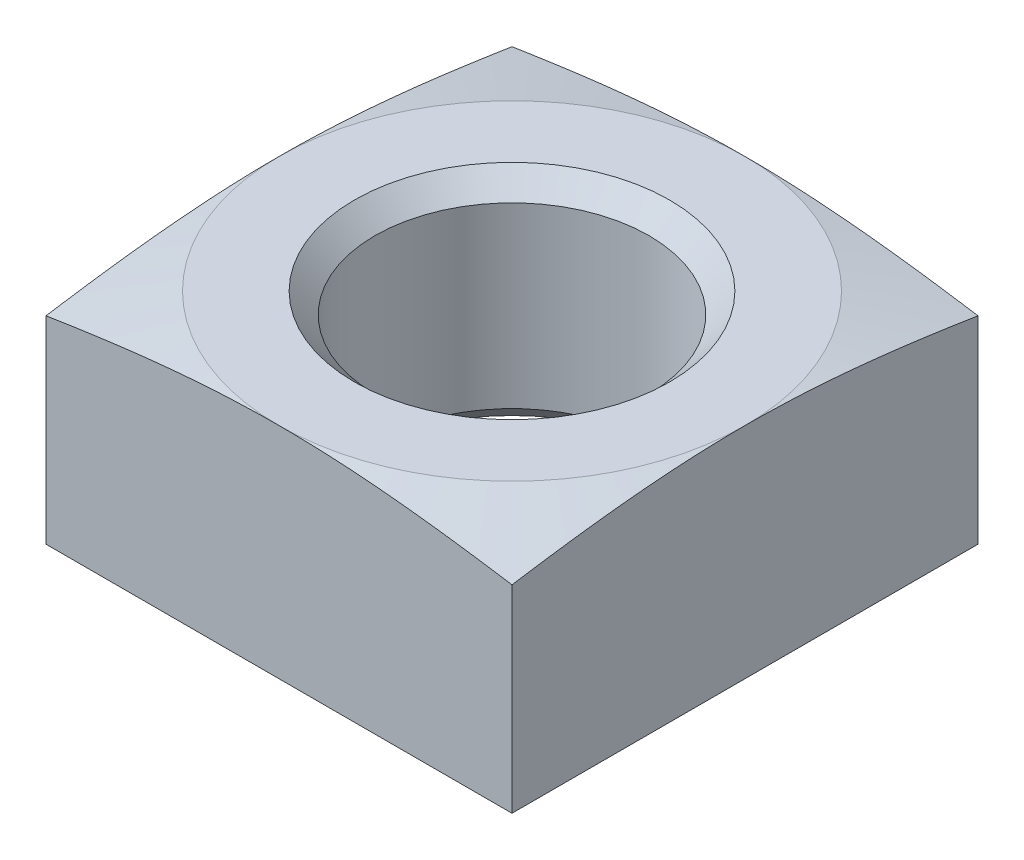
ISO-10303-21;
HEADER;
FILE_DESCRIPTION(('STEP AP214'),'2;1');
FILE_NAME('part.step','',(''),(''),'','','');
FILE_SCHEMA(('AUTOMOTIVE_DESIGN { 1 0 10303 214 1 1 1 1 }'));
ENDSEC;
DATA;
#1=APPLICATION_CONTEXT('core data for automotive mechanical design processes');
#2=APPLICATION_PROTOCOL_DEFINITION('international standard','automotive_design',2000,#1);
#3=PRODUCT_CONTEXT('',#1,'mechanical');
#4=PRODUCT('Part','Part','',(#3));
#5=PRODUCT_RELATED_PRODUCT_CATEGORY('part','',(#4));
#6=PRODUCT_DEFINITION_FORMATION('','',#4);
#7=PRODUCT_DEFINITION_CONTEXT('part definition',#1,'design');
#8=PRODUCT_DEFINITION('design','',#6,#7);
#9=PRODUCT_DEFINITION_SHAPE('','',#8);
#10=(LENGTH_UNIT() NAMED_UNIT(*) SI_UNIT(.MILLI.,.METRE.));
#11=(NAMED_UNIT(*) PLANE_ANGLE_UNIT() SI_UNIT($,.RADIAN.));
#12=(NAMED_UNIT(*) SI_UNIT($,.STERADIAN.) SOLID_ANGLE_UNIT());
#13=UNCERTAINTY_MEASURE_WITH_UNIT(LENGTH_MEASURE(1.E-05),#10,'distance_accuracy_value','');
#14=(GEOMETRIC_REPRESENTATION_CONTEXT(3) GLOBAL_UNCERTAINTY_ASSIGNED_CONTEXT((#13)) GLOBAL_UNIT_ASSIGNED_CONTEXT((#10,
#11,#12)) REPRESENTATION_CONTEXT('',''));
#15=CARTESIAN_POINT('',(0.,0.,0.));
#16=DIRECTION('',(0.,0.,1.));
#17=DIRECTION('',(1.,0.,0.));
#18=AXIS2_PLACEMENT_3D('',#15,#16,#17);
#19=CARTESIAN_POINT('',(8.5,4.,8.5));
#20=DIRECTION('',(0.,0.,-1.));
#21=DIRECTION('',(0.,1.,0.));
#22=AXIS2_PLACEMENT_3D('',#19,#20,#21);
#23=PLANE('',#22);
#24=DIRECTION('',(0.,-1.,0.));
#25=VECTOR('',#24,1.);
#26=CARTESIAN_POINT('',(8.5,4.,8.5));
#27=LINE('',#26,#25);
#28=CARTESIAN_POINT('',(8.5,3.21759660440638,8.5));
#29=VERTEX_POINT('',#28);
#30=CARTESIAN_POINT('',(8.5,-4.,8.5));
#31=VERTEX_POINT('',#30);
#32=EDGE_CURVE('E122',#29,#31,#27,.T.);
#33=ORIENTED_EDGE('',*,*,#32,.F.);
#34=CARTESIAN_POINT('',(-16.9605384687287,1.67304654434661,8.5));
#35=CARTESIAN_POINT('',(-16.5201000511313,1.76053361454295,8.5));
#36=CARTESIAN_POINT('',(-16.0795348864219,1.84738932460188,8.5));
#37=CARTESIAN_POINT('',(-15.1980862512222,2.01949712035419,8.5));
#38=CARTESIAN_POINT('',(-14.7572027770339,2.10474918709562,8.5));
#39=CARTESIAN_POINT('',(-13.875113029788,2.27329717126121,8.5));
#40=CARTESIAN_POINT('',(-13.4339067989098,2.35659330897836,8.5));
#41=CARTESIAN_POINT('',(-12.5510455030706,2.52077207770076,8.5));
#42=CARTESIAN_POINT('',(-12.1093904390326,2.60165471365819,8.5));
#43=CARTESIAN_POINT('',(-11.2271153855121,2.76012260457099,8.5));
#44=CARTESIAN_POINT('',(-10.7864973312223,2.83771860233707,8.5));
#45=CARTESIAN_POINT('',(-9.90461451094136,2.98914012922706,8.5));
#46=CARTESIAN_POINT('',(-9.46334974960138,3.06296568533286,8.5));
#47=CARTESIAN_POINT('',(-8.5798734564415,3.20586133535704,8.5));
#48=CARTESIAN_POINT('',(-8.13766162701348,3.2749295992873,8.5));
#49=CARTESIAN_POINT('',(-7.25231996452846,3.4069697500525,8.5));
#50=CARTESIAN_POINT('',(-6.80919012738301,3.46994160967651,8.5));
#51=CARTESIAN_POINT('',(-5.91813488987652,3.58863560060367,8.5));
#52=CARTESIAN_POINT('',(-5.4702006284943,3.64429191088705,8.5));
#53=CARTESIAN_POINT('',(-4.57319525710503,3.74568121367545,8.5));
#54=CARTESIAN_POINT('',(-4.12412414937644,3.79141422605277,8.5));
#55=CARTESIAN_POINT('',(-3.22526413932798,3.87066936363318,8.5));
#56=CARTESIAN_POINT('',(-2.77547615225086,3.90420167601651,8.5));
#57=CARTESIAN_POINT('',(-1.87505584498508,3.9569925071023,8.5));
#58=CARTESIAN_POINT('',(-1.42442354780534,3.97625140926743,8.5));
#59=CARTESIAN_POINT('',(-0.521521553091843,3.99907945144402,8.5));
#60=CARTESIAN_POINT('',(-0.0692507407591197,4.00260567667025,8.5));
#61=CARTESIAN_POINT('',(0.835127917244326,3.99356248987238,8.5));
#62=CARTESIAN_POINT('',(1.28723576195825,3.98099298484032,8.5));
#63=CARTESIAN_POINT('',(2.19111156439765,3.94073999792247,8.5));
#64=CARTESIAN_POINT('',(2.6428789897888,3.91304484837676,8.5));
#65=CARTESIAN_POINT('',(3.54538769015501,3.84444705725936,8.5));
#66=CARTESIAN_POINT('',(3.99612896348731,3.80354439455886,8.5));
#67=CARTESIAN_POINT('',(5.08609560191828,3.69128893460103,8.5));
#68=CARTESIAN_POINT('',(5.72474126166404,3.61436713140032,8.5));
#69=CARTESIAN_POINT('',(6.99993141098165,3.44456325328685,8.5));
#70=CARTESIAN_POINT('',(7.63647561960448,3.35167912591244,8.5));
#71=CARTESIAN_POINT('',(8.90806817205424,3.15459628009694,8.5));
#72=CARTESIAN_POINT('',(9.54311576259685,3.05039275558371,8.5));
#73=CARTESIAN_POINT('',(10.8118046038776,2.83399980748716,8.5));
#74=CARTESIAN_POINT('',(11.4454459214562,2.72181077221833,8.5));
#75=CARTESIAN_POINT('',(12.7126546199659,2.49151420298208,8.5));
#76=CARTESIAN_POINT('',(13.3462203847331,2.37339782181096,8.5));
#77=CARTESIAN_POINT('',(14.6125540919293,2.1329473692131,8.5));
#78=CARTESIAN_POINT('',(15.2453220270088,2.01061325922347,8.5));
#79=CARTESIAN_POINT('',(16.5100787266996,1.76282780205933,8.5));
#80=CARTESIAN_POINT('',(17.1420676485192,1.63737725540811,8.5));
#81=CARTESIAN_POINT('',(18.4055605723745,1.3840726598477,8.5));
#82=CARTESIAN_POINT('',(19.0370645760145,1.25621861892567,8.5));
#83=CARTESIAN_POINT('',(20.9252709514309,0.871062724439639,8.5));
#84=CARTESIAN_POINT('',(22.1814157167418,0.611029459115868,8.5));
#85=CARTESIAN_POINT('',(24.6928419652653,0.0863551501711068,8.5));
#86=CARTESIAN_POINT('',(25.948123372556,-0.17828625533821,8.5));
#87=CARTESIAN_POINT('',(28.4538843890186,-0.709780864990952,8.5));
#88=CARTESIAN_POINT('',(29.7043661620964,-0.976623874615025,8.5));
#89=CARTESIAN_POINT('',(31.5796887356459,-1.37849023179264,8.5));
#90=CARTESIAN_POINT('',(32.2047027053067,-1.51270685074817,8.5));
#91=CARTESIAN_POINT('',(33.4546309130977,-1.78160238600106,8.5));
#92=CARTESIAN_POINT('',(34.0795451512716,-1.91628130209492,8.5));
#93=CARTESIAN_POINT('',(34.7044176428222,-2.0511537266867,8.5));
#94=B_SPLINE_CURVE_WITH_KNOTS('',3,(#34,#35,#36,#37,#38,#39,#40,#41,#42,#43,#44,#45,#46,#47,#48,
#49,#50,#51,#52,#53,#54,#55,#56,#57,#58,#59,#60,#61,#62,#63,#64,#65,#66,#67,#68,#69,#70,#71,#72,
#73,#74,#75,#76,#77,#78,#79,#80,#81,#82,#83,#84,#85,#86,#87,#88,#89,#90,#91,#92,#93),
.UNSPECIFIED.,.F.,.F.,(4,2,2,2,2,2,2,2,2,2,2,2,2,2,2,2,2,2,2,2,2,2,2,2,2,2,2,2,2,4),(0.,
1.347131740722,2.69427939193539,4.0412745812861,5.38826700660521,6.7304496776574,
8.07262274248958,9.41530925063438,10.7580017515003,12.1120504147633,13.466096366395,
14.8190091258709,16.1718855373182,17.5284500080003,18.8850223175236,20.2426425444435,
21.6002649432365,23.52974237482,25.4594680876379,27.3900163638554,29.3204708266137,
31.2538977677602,33.1873423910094,35.120295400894,37.0532419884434,40.9015569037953,
44.7501754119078,48.5860802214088,50.5038676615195,52.4216542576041),.UNSPECIFIED.);
#95=CARTESIAN_POINT('',(0.,4.,8.5));
#96=VERTEX_POINT('',#95);
#97=EDGE_CURVE('E99',#29,#96,#94,.F.);
#98=ORIENTED_EDGE('',*,*,#97,.T.);
#99=CARTESIAN_POINT('',(-8.5,3.21759660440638,8.5));
#100=VERTEX_POINT('',#99);
#101=EDGE_CURVE('E112',#96,#100,#94,.F.);
#102=ORIENTED_EDGE('',*,*,#101,.T.);
#103=DIRECTION('',(0.,-1.,0.));
#104=VECTOR('',#103,1.);
#105=CARTESIAN_POINT('',(-8.5,4.,8.5));
#106=LINE('',#105,#104);
#107=CARTESIAN_POINT('',(-8.5,-4.,8.5));
#108=VERTEX_POINT('',#107);
#109=EDGE_CURVE('E185',#100,#108,#106,.T.);
#110=ORIENTED_EDGE('',*,*,#109,.T.);
#111=DIRECTION('',(-1.,0.,0.));
#112=VECTOR('',#111,1.);
#113=CARTESIAN_POINT('',(8.5,-4.,8.5));
#114=LINE('',#113,#112);
#115=EDGE_CURVE('E194',#31,#108,#114,.T.);
#116=ORIENTED_EDGE('',*,*,#115,.F.);
#117=EDGE_LOOP('',(#33,#98,#102,#110,#116));
#118=FACE_BOUND('',#117,.T.);
#119=ADVANCED_FACE('F39',(#118),#23,.F.);
#120=CARTESIAN_POINT('',(8.5,-4.,-8.5));
#121=DIRECTION('',(0.,1.,0.));
#122=DIRECTION('',(0.,0.,1.));
#123=AXIS2_PLACEMENT_3D('',#120,#121,#122);
#124=PLANE('',#123);
#125=CARTESIAN_POINT('',(0.,-4.,0.));
#126=DIRECTION('',(0.,1.,0.));
#127=DIRECTION('',(0.,0.,1.));
#128=AXIS2_PLACEMENT_3D('',#125,#126,#127);
#129=CIRCLE('',#128,5.75);
#130=CARTESIAN_POINT('',(0.,-4.,5.75));
#131=VERTEX_POINT('',#130);
#132=EDGE_CURVE('E11',#131,#131,#129,.T.);
#133=ORIENTED_EDGE('',*,*,#132,.T.);
#134=EDGE_LOOP('',(#133));
#135=FACE_BOUND('',#134,.T.);
#136=DIRECTION('',(0.,0.,-1.));
#137=VECTOR('',#136,1.);
#138=CARTESIAN_POINT('',(-8.5,-4.,-8.5));
#139=LINE('',#138,#137);
#140=CARTESIAN_POINT('',(-8.5,-4.,-8.5));
#141=VERTEX_POINT('',#140);
#142=EDGE_CURVE('E188',#108,#141,#139,.T.);
#143=ORIENTED_EDGE('',*,*,#142,.T.);
#144=DIRECTION('',(-1.,0.,0.));
#145=VECTOR('',#144,1.);
#146=CARTESIAN_POINT('',(8.5,-4.,-8.5));
#147=LINE('',#146,#145);
#148=CARTESIAN_POINT('',(8.5,-4.,-8.5));
#149=VERTEX_POINT('',#148);
#150=EDGE_CURVE('E184',#149,#141,#147,.T.);
#151=ORIENTED_EDGE('',*,*,#150,.F.);
#152=DIRECTION('',(0.,0.,-1.));
#153=VECTOR('',#152,1.);
#154=CARTESIAN_POINT('',(8.5,-4.,-8.5));
#155=LINE('',#154,#153);
#156=EDGE_CURVE('E176',#31,#149,#155,.T.);
#157=ORIENTED_EDGE('',*,*,#156,.F.);
#158=ORIENTED_EDGE('',*,*,#115,.T.);
#159=EDGE_LOOP('',(#143,#151,#157,#158));
#160=FACE_BOUND('',#159,.T.);
#161=ADVANCED_FACE('F225',(#135,#160),#124,.F.);
#162=CARTESIAN_POINT('',(8.5,4.,-8.5));
#163=DIRECTION('',(0.,0.,1.));
#164=DIRECTION('',(1.,0.,0.));
#165=AXIS2_PLACEMENT_3D('',#162,#163,#164);
#166=PLANE('',#165);
#167=DIRECTION('',(0.,1.,0.));
#168=VECTOR('',#167,1.);
#169=CARTESIAN_POINT('',(-8.5,4.,-8.5));
#170=LINE('',#169,#168);
#171=CARTESIAN_POINT('',(-8.5,3.21759660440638,-8.5));
#172=VERTEX_POINT('',#171);
#173=EDGE_CURVE('E177',#141,#172,#170,.T.);
#174=ORIENTED_EDGE('',*,*,#173,.T.);
#175=CARTESIAN_POINT('',(-16.9605271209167,1.67304879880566,-8.5));
#176=CARTESIAN_POINT('',(-16.5200891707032,1.76053576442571,-8.5));
#177=CARTESIAN_POINT('',(-16.079524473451,1.84739137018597,-8.5));
#178=CARTESIAN_POINT('',(-15.1980767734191,2.01949895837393,-8.5));
#179=CARTESIAN_POINT('',(-14.7571937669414,2.10475092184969,-8.5));
#180=CARTESIAN_POINT('',(-13.8751049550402,2.2732987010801,-8.5));
#181=CARTESIAN_POINT('',(-13.4338991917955,2.35659473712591,-8.5));
#182=CARTESIAN_POINT('',(-12.5510388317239,2.52077330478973,-8.5));
#183=CARTESIAN_POINT('',(-12.1093842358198,2.6016558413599,-8.5));
#184=CARTESIAN_POINT('',(-11.2271101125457,2.76012353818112,-8.5));
#185=CARTESIAN_POINT('',(-10.7864925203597,2.83771944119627,-8.5));
#186=CARTESIAN_POINT('',(-9.90461062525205,2.98914078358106,-8.5));
#187=CARTESIAN_POINT('',(-9.46334632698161,3.0629662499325,-8.5));
#188=CARTESIAN_POINT('',(-8.57987096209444,3.20586172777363,-8.5));
#189=CARTESIAN_POINT('',(-8.13765959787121,3.27492990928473,-8.5));
#190=CARTESIAN_POINT('',(-7.25231886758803,3.40696990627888,-8.5));
#191=CARTESIAN_POINT('',(-6.80918949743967,3.46994169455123,-8.5));
#192=CARTESIAN_POINT('',(-5.91813522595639,3.58863555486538,-8.5));
#193=CARTESIAN_POINT('',(-5.47020146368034,3.64429180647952,-8.5));
#194=CARTESIAN_POINT('',(-4.57319709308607,3.74568101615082,-8.5));
#195=CARTESIAN_POINT('',(-4.12412648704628,3.79141399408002,-8.5));
#196=CARTESIAN_POINT('',(-3.22526748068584,3.87066909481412,-8.5));
#197=CARTESIAN_POINT('',(-2.77547999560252,3.90420140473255,-8.5));
#198=CARTESIAN_POINT('',(-1.8750606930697,3.95699226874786,-8.5));
#199=CARTESIAN_POINT('',(-1.42442889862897,3.97625120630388,-8.5));
#200=CARTESIAN_POINT('',(-0.521527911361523,3.99907935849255,-8.5));
#201=CARTESIAN_POINT('',(-0.0692576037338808,4.0026056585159,-8.5));
#202=CARTESIAN_POINT('',(0.83512004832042,3.99356265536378,-8.5));
#203=CARTESIAN_POINT('',(1.28722739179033,3.98099325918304,-8.5));
#204=CARTESIAN_POINT('',(2.19110219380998,3.94074051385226,-8.5));
#205=CARTESIAN_POINT('',(2.64286912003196,3.91304549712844,-8.5));
#206=CARTESIAN_POINT('',(3.54537682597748,3.84444798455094,-8.5));
#207=CARTESIAN_POINT('',(3.99611760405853,3.80354546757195,-8.5));
#208=CARTESIAN_POINT('',(5.08608375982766,3.69129029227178,-8.5));
#209=CARTESIAN_POINT('',(5.72472943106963,3.61436860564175,-8.5));
#210=CARTESIAN_POINT('',(6.99991960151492,3.44456492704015,-8.5));
#211=CARTESIAN_POINT('',(7.63646381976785,3.35168088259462,-8.5));
#212=CARTESIAN_POINT('',(8.90805639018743,3.15459817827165,-8.5));
#213=CARTESIAN_POINT('',(9.54310398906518,3.05039471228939,-8.5));
#214=CARTESIAN_POINT('',(10.8117928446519,2.83400186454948,-8.5));
#215=CARTESIAN_POINT('',(11.4454341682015,2.72181287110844,-8.5));
#216=CARTESIAN_POINT('',(12.7126428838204,2.49151637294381,-8.5));
#217=CARTESIAN_POINT('',(13.3462086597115,2.37340002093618,-8.5));
#218=CARTESIAN_POINT('',(14.6125423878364,2.13294961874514,-8.5));
#219=CARTESIAN_POINT('',(15.2453103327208,2.01061552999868,-8.5));
#220=CARTESIAN_POINT('',(16.5100670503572,1.76283010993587,-8.5));
#221=CARTESIAN_POINT('',(17.1420559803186,1.63737957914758,-8.5));
#222=CARTESIAN_POINT('',(18.4055489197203,1.38407501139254,-8.5));
#223=CARTESIAN_POINT('',(19.037052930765,1.25622098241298,-8.5));
#224=CARTESIAN_POINT('',(20.9252593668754,0.871065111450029,-8.5));
#225=CARTESIAN_POINT('',(22.181404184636,0.611031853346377,-8.5));
#226=CARTESIAN_POINT('',(24.6928305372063,0.0863575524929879,-8.5));
#227=CARTESIAN_POINT('',(25.9481119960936,-0.178283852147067,-8.5));
#228=CARTESIAN_POINT('',(28.4538730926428,-0.709778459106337,-8.5));
#229=CARTESIAN_POINT('',(29.704354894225,-0.976621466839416,-8.5));
#230=CARTESIAN_POINT('',(31.5796775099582,-1.37848782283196,-8.5));
#231=CARTESIAN_POINT('',(32.2046914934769,-1.51270444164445,-8.5));
#232=CARTESIAN_POINT('',(33.4546197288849,-1.78159997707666,-8.5));
#233=CARTESIAN_POINT('',(34.0795339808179,-1.91627889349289,-8.5));
#234=CARTESIAN_POINT('',(34.7044064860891,-2.0511513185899,-8.5));
#235=B_SPLINE_CURVE_WITH_KNOTS('',3,(#175,#176,#177,#178,#179,#180,#181,#182,#183,#184,#185,
#186,#187,#188,#189,#190,#191,#192,#193,#194,#195,#196,#197,#198,#199,#200,#201,#202,#203,#204,
#205,#206,#207,#208,#209,#210,#211,#212,#213,#214,#215,#216,#217,#218,#219,#220,#221,#222,#223,
#224,#225,#226,#227,#228,#229,#230,#231,#232,#233,#234),.UNSPECIFIED.,.F.,.F.,(4,2,2,2,2,2,2,2,
2,2,2,2,2,2,2,2,2,2,2,2,2,2,2,2,2,2,2,2,2,4),(0.,1.34713030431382,2.69427651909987,
4.04127027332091,5.38826126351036,6.73044251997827,8.07261417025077,9.41529926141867,
10.7579903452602,12.1120375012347,13.4660819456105,14.8189932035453,16.1718681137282,
17.528431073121,18.8850018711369,20.242620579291,21.6002414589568,23.5297188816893,
25.4594445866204,27.3899928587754,29.3204473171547,31.2538742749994,33.1873189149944,
35.1202719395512,37.0532185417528,40.9015336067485,44.7501522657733,48.5860571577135,
50.5038446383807,52.4216312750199),.UNSPECIFIED.);
#236=CARTESIAN_POINT('',(0.,4.,-8.5));
#237=VERTEX_POINT('',#236);
#238=EDGE_CURVE('E62',#172,#237,#235,.T.);
#239=ORIENTED_EDGE('',*,*,#238,.T.);
#240=CARTESIAN_POINT('',(8.5,3.21759660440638,-8.5));
#241=VERTEX_POINT('',#240);
#242=EDGE_CURVE('E138',#237,#241,#235,.T.);
#243=ORIENTED_EDGE('',*,*,#242,.T.);
#244=DIRECTION('',(0.,1.,0.));
#245=VECTOR('',#244,1.);
#246=CARTESIAN_POINT('',(8.5,4.,-8.5));
#247=LINE('',#246,#245);
#248=EDGE_CURVE('E180',#149,#241,#247,.T.);
#249=ORIENTED_EDGE('',*,*,#248,.F.);
#250=ORIENTED_EDGE('',*,*,#150,.T.);
#251=EDGE_LOOP('',(#174,#239,#243,#249,#250));
#252=FACE_BOUND('',#251,.T.);
#253=ADVANCED_FACE('F144',(#252),#166,.F.);
#254=CARTESIAN_POINT('',(8.5,0.,0.));
#255=DIRECTION('',(-1.,0.,0.));
#256=DIRECTION('',(0.,0.,1.));
#257=AXIS2_PLACEMENT_3D('',#254,#255,#256);
#258=PLANE('',#257);
#259=ORIENTED_EDGE('',*,*,#248,.T.);
#260=CARTESIAN_POINT('',(8.5,1.67304879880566,-16.9605271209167));
#261=CARTESIAN_POINT('',(8.5,1.76053576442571,-16.5200891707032));
#262=CARTESIAN_POINT('',(8.5,1.84739137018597,-16.079524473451));
#263=CARTESIAN_POINT('',(8.5,2.01949895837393,-15.1980767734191));
#264=CARTESIAN_POINT('',(8.5,2.10475092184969,-14.7571937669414));
#265=CARTESIAN_POINT('',(8.5,2.2732987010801,-13.8751049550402));
#266=CARTESIAN_POINT('',(8.5,2.35659473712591,-13.4338991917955));
#267=CARTESIAN_POINT('',(8.5,2.52077330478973,-12.5510388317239));
#268=CARTESIAN_POINT('',(8.5,2.6016558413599,-12.1093842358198));
#269=CARTESIAN_POINT('',(8.5,2.76012353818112,-11.2271101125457));
#270=CARTESIAN_POINT('',(8.5,2.83771944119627,-10.7864925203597));
#271=CARTESIAN_POINT('',(8.5,2.98914078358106,-9.90461062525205));
#272=CARTESIAN_POINT('',(8.5,3.0629662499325,-9.46334632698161));
#273=CARTESIAN_POINT('',(8.5,3.20586172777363,-8.57987096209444));
#274=CARTESIAN_POINT('',(8.5,3.27492990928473,-8.13765959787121));
#275=CARTESIAN_POINT('',(8.5,3.40696990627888,-7.25231886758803));
#276=CARTESIAN_POINT('',(8.5,3.46994169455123,-6.80918949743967));
#277=CARTESIAN_POINT('',(8.5,3.58863555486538,-5.91813522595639));
#278=CARTESIAN_POINT('',(8.5,3.64429180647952,-5.47020146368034));
#279=CARTESIAN_POINT('',(8.5,3.74568101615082,-4.57319709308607));
#280=CARTESIAN_POINT('',(8.5,3.79141399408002,-4.12412648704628));
#281=CARTESIAN_POINT('',(8.5,3.87066909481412,-3.22526748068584));
#282=CARTESIAN_POINT('',(8.5,3.90420140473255,-2.77547999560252));
#283=CARTESIAN_POINT('',(8.5,3.95699226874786,-1.8750606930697));
#284=CARTESIAN_POINT('',(8.5,3.97625120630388,-1.42442889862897));
#285=CARTESIAN_POINT('',(8.5,3.99907935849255,-0.521527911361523));
#286=CARTESIAN_POINT('',(8.5,4.0026056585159,-0.0692576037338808));
#287=CARTESIAN_POINT('',(8.5,3.99356265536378,0.83512004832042));
#288=CARTESIAN_POINT('',(8.5,3.98099325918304,1.28722739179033));
#289=CARTESIAN_POINT('',(8.5,3.94074051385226,2.19110219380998));
#290=CARTESIAN_POINT('',(8.5,3.91304549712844,2.64286912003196));
#291=CARTESIAN_POINT('',(8.5,3.84444798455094,3.54537682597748));
#292=CARTESIAN_POINT('',(8.5,3.80354546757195,3.99611760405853));
#293=CARTESIAN_POINT('',(8.5,3.69129029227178,5.08608375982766));
#294=CARTESIAN_POINT('',(8.5,3.61436860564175,5.72472943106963));
#295=CARTESIAN_POINT('',(8.5,3.44456492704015,6.99991960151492));
#296=CARTESIAN_POINT('',(8.5,3.35168088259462,7.63646381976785));
#297=CARTESIAN_POINT('',(8.5,3.15459817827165,8.90805639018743));
#298=CARTESIAN_POINT('',(8.5,3.05039471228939,9.54310398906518));
#299=CARTESIAN_POINT('',(8.5,2.83400186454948,10.8117928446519));
#300=CARTESIAN_POINT('',(8.5,2.72181287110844,11.4454341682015));
#301=CARTESIAN_POINT('',(8.5,2.49151637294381,12.7126428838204));
#302=CARTESIAN_POINT('',(8.5,2.37340002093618,13.3462086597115));
#303=CARTESIAN_POINT('',(8.5,2.13294961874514,14.6125423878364));
#304=CARTESIAN_POINT('',(8.5,2.01061552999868,15.2453103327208));
#305=CARTESIAN_POINT('',(8.5,1.76283010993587,16.5100670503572));
#306=CARTESIAN_POINT('',(8.5,1.63737957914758,17.1420559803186));
#307=CARTESIAN_POINT('',(8.5,1.38407501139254,18.4055489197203));
#308=CARTESIAN_POINT('',(8.5,1.25622098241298,19.037052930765));
#309=CARTESIAN_POINT('',(8.5,0.871065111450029,20.9252593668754));
#310=CARTESIAN_POINT('',(8.5,0.611031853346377,22.181404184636));
#311=CARTESIAN_POINT('',(8.5,0.0863575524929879,24.6928305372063));
#312=CARTESIAN_POINT('',(8.5,-0.178283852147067,25.9481119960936));
#313=CARTESIAN_POINT('',(8.5,-0.709778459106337,28.4538730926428));
#314=CARTESIAN_POINT('',(8.5,-0.976621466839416,29.704354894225));
#315=CARTESIAN_POINT('',(8.5,-1.37848782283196,31.5796775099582));
#316=CARTESIAN_POINT('',(8.5,-1.51270444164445,32.2046914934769));
#317=CARTESIAN_POINT('',(8.5,-1.78159997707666,33.4546197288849));
#318=CARTESIAN_POINT('',(8.5,-1.91627889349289,34.0795339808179));
#319=CARTESIAN_POINT('',(8.5,-2.0511513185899,34.7044064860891));
#320=B_SPLINE_CURVE_WITH_KNOTS('',3,(#260,#261,#262,#263,#264,#265,#266,#267,#268,#269,#270,
#271,#272,#273,#274,#275,#276,#277,#278,#279,#280,#281,#282,#283,#284,#285,#286,#287,#288,#289,
#290,#291,#292,#293,#294,#295,#296,#297,#298,#299,#300,#301,#302,#303,#304,#305,#306,#307,#308,
#309,#310,#311,#312,#313,#314,#315,#316,#317,#318,#319),.UNSPECIFIED.,.F.,.F.,(4,2,2,2,2,2,2,2,
2,2,2,2,2,2,2,2,2,2,2,2,2,2,2,2,2,2,2,2,2,4),(0.,1.34713030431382,2.69427651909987,
4.04127027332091,5.38826126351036,6.73044251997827,8.07261417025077,9.41529926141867,
10.7579903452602,12.1120375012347,13.4660819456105,14.8189932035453,16.1718681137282,
17.528431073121,18.8850018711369,20.242620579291,21.6002414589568,23.5297188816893,
25.4594445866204,27.3899928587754,29.3204473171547,31.2538742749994,33.1873189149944,
35.1202719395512,37.0532185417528,40.9015336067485,44.7501522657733,48.5860571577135,
50.5038446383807,52.4216312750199),.UNSPECIFIED.);
#321=CARTESIAN_POINT('',(8.5,4.,0.));
#322=VERTEX_POINT('',#321);
#323=EDGE_CURVE('E173',#241,#322,#320,.T.);
#324=ORIENTED_EDGE('',*,*,#323,.T.);
#325=EDGE_CURVE('E101',#322,#29,#320,.T.);
#326=ORIENTED_EDGE('',*,*,#325,.T.);
#327=ORIENTED_EDGE('',*,*,#32,.T.);
#328=ORIENTED_EDGE('',*,*,#156,.T.);
#329=EDGE_LOOP('',(#259,#324,#326,#327,#328));
#330=FACE_BOUND('',#329,.T.);
#331=ADVANCED_FACE('F156',(#330),#258,.F.);
#332=CARTESIAN_POINT('',(-8.5,0.,0.));
#333=DIRECTION('',(-1.,0.,0.));
#334=DIRECTION('',(0.,0.,1.));
#335=AXIS2_PLACEMENT_3D('',#332,#333,#334);
#336=PLANE('',#335);
#337=CARTESIAN_POINT('',(-8.5,1.67304879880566,-16.9605271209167));
#338=CARTESIAN_POINT('',(-8.5,1.76053576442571,-16.5200891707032));
#339=CARTESIAN_POINT('',(-8.5,1.84739137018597,-16.079524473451));
#340=CARTESIAN_POINT('',(-8.5,2.01949895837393,-15.1980767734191));
#341=CARTESIAN_POINT('',(-8.5,2.10475092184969,-14.7571937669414));
#342=CARTESIAN_POINT('',(-8.5,2.2732987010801,-13.8751049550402));
#343=CARTESIAN_POINT('',(-8.5,2.35659473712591,-13.4338991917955));
#344=CARTESIAN_POINT('',(-8.5,2.52077330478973,-12.5510388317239));
#345=CARTESIAN_POINT('',(-8.5,2.6016558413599,-12.1093842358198));
#346=CARTESIAN_POINT('',(-8.5,2.76012353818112,-11.2271101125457));
#347=CARTESIAN_POINT('',(-8.5,2.83771944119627,-10.7864925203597));
#348=CARTESIAN_POINT('',(-8.5,2.98914078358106,-9.90461062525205));
#349=CARTESIAN_POINT('',(-8.5,3.0629662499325,-9.46334632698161));
#350=CARTESIAN_POINT('',(-8.5,3.20586172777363,-8.57987096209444));
#351=CARTESIAN_POINT('',(-8.5,3.27492990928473,-8.13765959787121));
#352=CARTESIAN_POINT('',(-8.5,3.40696990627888,-7.25231886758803));
#353=CARTESIAN_POINT('',(-8.5,3.46994169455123,-6.80918949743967));
#354=CARTESIAN_POINT('',(-8.5,3.58863555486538,-5.91813522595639));
#355=CARTESIAN_POINT('',(-8.5,3.64429180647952,-5.47020146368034));
#356=CARTESIAN_POINT('',(-8.5,3.74568101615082,-4.57319709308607));
#357=CARTESIAN_POINT('',(-8.5,3.79141399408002,-4.12412648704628));
#358=CARTESIAN_POINT('',(-8.5,3.87066909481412,-3.22526748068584));
#359=CARTESIAN_POINT('',(-8.5,3.90420140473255,-2.77547999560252));
#360=CARTESIAN_POINT('',(-8.5,3.95699226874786,-1.8750606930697));
#361=CARTESIAN_POINT('',(-8.5,3.97625120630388,-1.42442889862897));
#362=CARTESIAN_POINT('',(-8.5,3.99907935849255,-0.521527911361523));
#363=CARTESIAN_POINT('',(-8.5,4.0026056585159,-0.0692576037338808));
#364=CARTESIAN_POINT('',(-8.5,3.99356265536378,0.83512004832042));
#365=CARTESIAN_POINT('',(-8.5,3.98099325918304,1.28722739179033));
#366=CARTESIAN_POINT('',(-8.5,3.94074051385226,2.19110219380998));
#367=CARTESIAN_POINT('',(-8.5,3.91304549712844,2.64286912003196));
#368=CARTESIAN_POINT('',(-8.5,3.84444798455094,3.54537682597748));
#369=CARTESIAN_POINT('',(-8.5,3.80354546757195,3.99611760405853));
#370=CARTESIAN_POINT('',(-8.5,3.69129029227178,5.08608375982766));
#371=CARTESIAN_POINT('',(-8.5,3.61436860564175,5.72472943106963));
#372=CARTESIAN_POINT('',(-8.5,3.44456492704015,6.99991960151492));
#373=CARTESIAN_POINT('',(-8.5,3.35168088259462,7.63646381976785));
#374=CARTESIAN_POINT('',(-8.5,3.15459817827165,8.90805639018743));
#375=CARTESIAN_POINT('',(-8.5,3.05039471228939,9.54310398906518));
#376=CARTESIAN_POINT('',(-8.5,2.83400186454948,10.8117928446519));
#377=CARTESIAN_POINT('',(-8.5,2.72181287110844,11.4454341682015));
#378=CARTESIAN_POINT('',(-8.5,2.49151637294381,12.7126428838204));
#379=CARTESIAN_POINT('',(-8.5,2.37340002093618,13.3462086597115));
#380=CARTESIAN_POINT('',(-8.5,2.13294961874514,14.6125423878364));
#381=CARTESIAN_POINT('',(-8.5,2.01061552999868,15.2453103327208));
#382=CARTESIAN_POINT('',(-8.5,1.76283010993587,16.5100670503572));
#383=CARTESIAN_POINT('',(-8.5,1.63737957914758,17.1420559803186));
#384=CARTESIAN_POINT('',(-8.5,1.38407501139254,18.4055489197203));
#385=CARTESIAN_POINT('',(-8.5,1.25622098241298,19.037052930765));
#386=CARTESIAN_POINT('',(-8.5,0.871065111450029,20.9252593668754));
#387=CARTESIAN_POINT('',(-8.5,0.611031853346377,22.181404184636));
#388=CARTESIAN_POINT('',(-8.5,0.0863575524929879,24.6928305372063));
#389=CARTESIAN_POINT('',(-8.5,-0.178283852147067,25.9481119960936));
#390=CARTESIAN_POINT('',(-8.5,-0.709778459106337,28.4538730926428));
#391=CARTESIAN_POINT('',(-8.5,-0.976621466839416,29.704354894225));
#392=CARTESIAN_POINT('',(-8.5,-1.37848782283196,31.5796775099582));
#393=CARTESIAN_POINT('',(-8.5,-1.51270444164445,32.2046914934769));
#394=CARTESIAN_POINT('',(-8.5,-1.78159997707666,33.4546197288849));
#395=CARTESIAN_POINT('',(-8.5,-1.91627889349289,34.0795339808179));
#396=CARTESIAN_POINT('',(-8.5,-2.0511513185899,34.7044064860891));
#397=B_SPLINE_CURVE_WITH_KNOTS('',3,(#337,#338,#339,#340,#341,#342,#343,#344,#345,#346,#347,
#348,#349,#350,#351,#352,#353,#354,#355,#356,#357,#358,#359,#360,#361,#362,#363,#364,#365,#366,
#367,#368,#369,#370,#371,#372,#373,#374,#375,#376,#377,#378,#379,#380,#381,#382,#383,#384,#385,
#386,#387,#388,#389,#390,#391,#392,#393,#394,#395,#396),.UNSPECIFIED.,.F.,.F.,(4,2,2,2,2,2,2,2,
2,2,2,2,2,2,2,2,2,2,2,2,2,2,2,2,2,2,2,2,2,4),(0.,1.34713030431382,2.69427651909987,
4.04127027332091,5.38826126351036,6.73044251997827,8.07261417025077,9.41529926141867,
10.7579903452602,12.1120375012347,13.4660819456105,14.8189932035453,16.1718681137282,
17.528431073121,18.8850018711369,20.242620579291,21.6002414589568,23.5297188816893,
25.4594445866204,27.3899928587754,29.3204473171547,31.2538742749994,33.1873189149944,
35.1202719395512,37.0532185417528,40.9015336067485,44.7501522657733,48.5860571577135,
50.5038446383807,52.4216312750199),.UNSPECIFIED.);
#398=CARTESIAN_POINT('',(-8.5,4.,0.));
#399=VERTEX_POINT('',#398);
#400=EDGE_CURVE('E55',#172,#399,#397,.T.);
#401=ORIENTED_EDGE('',*,*,#400,.F.);
#402=ORIENTED_EDGE('',*,*,#173,.F.);
#403=ORIENTED_EDGE('',*,*,#142,.F.);
#404=ORIENTED_EDGE('',*,*,#109,.F.);
#405=EDGE_CURVE('E115',#399,#100,#397,.T.);
#406=ORIENTED_EDGE('',*,*,#405,.F.);
#407=EDGE_LOOP('',(#401,#402,#403,#404,#406));
#408=FACE_BOUND('',#407,.T.);
#409=ADVANCED_FACE('F240',(#408),#336,.T.);
#410=CARTESIAN_POINT('',(0.,3.2,0.));
#411=DIRECTION('',(0.,-1.,0.));
#412=DIRECTION('',(0.,0.,-1.));
#413=AXIS2_PLACEMENT_3D('',#410,#411,#412);
#414=CONICAL_SURFACE('',#413,12.1,1.35212738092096);
#415=CARTESIAN_POINT('',(0.,4.,0.));
#416=DIRECTION('',(0.,1.,0.));
#417=DIRECTION('',(0.,0.,1.));
#418=AXIS2_PLACEMENT_3D('',#415,#416,#417);
#419=CIRCLE('',#418,8.5);
#420=EDGE_CURVE('E109',#399,#96,#419,.T.);
#421=ORIENTED_EDGE('',*,*,#420,.F.);
#422=ORIENTED_EDGE('',*,*,#405,.T.);
#423=ORIENTED_EDGE('',*,*,#101,.F.);
#424=EDGE_LOOP('',(#421,#422,#423));
#425=FACE_BOUND('',#424,.T.);
#426=ADVANCED_FACE('F113',(#425),#414,.T.);
#427=ORIENTED_EDGE('',*,*,#400,.T.);
#428=EDGE_CURVE('E126',#237,#399,#419,.T.);
#429=ORIENTED_EDGE('',*,*,#428,.F.);
#430=ORIENTED_EDGE('',*,*,#238,.F.);
#431=EDGE_LOOP('',(#427,#429,#430));
#432=FACE_BOUND('',#431,.T.);
#433=ADVANCED_FACE('F154',(#432),#414,.T.);
#434=EDGE_CURVE('E95',#96,#322,#419,.T.);
#435=ORIENTED_EDGE('',*,*,#434,.F.);
#436=ORIENTED_EDGE('',*,*,#97,.F.);
#437=ORIENTED_EDGE('',*,*,#325,.F.);
#438=EDGE_LOOP('',(#435,#436,#437));
#439=FACE_BOUND('',#438,.T.);
#440=ADVANCED_FACE('F97',(#439),#414,.T.);
#441=EDGE_CURVE('E107',#322,#237,#419,.T.);
#442=ORIENTED_EDGE('',*,*,#441,.F.);
#443=ORIENTED_EDGE('',*,*,#323,.F.);
#444=ORIENTED_EDGE('',*,*,#242,.F.);
#445=EDGE_LOOP('',(#442,#443,#444));
#446=FACE_BOUND('',#445,.T.);
#447=ADVANCED_FACE('F148',(#446),#414,.T.);
#448=CARTESIAN_POINT('',(8.5,4.,-8.5));
#449=DIRECTION('',(0.,-1.,0.));
#450=DIRECTION('',(0.,0.,-1.));
#451=AXIS2_PLACEMENT_3D('',#448,#449,#450);
#452=PLANE('',#451);
#453=CARTESIAN_POINT('',(0.,4.,0.));
#454=DIRECTION('',(0.,-1.,0.));
#455=DIRECTION('',(0.,0.,-1.));
#456=AXIS2_PLACEMENT_3D('',#453,#454,#455);
#457=CIRCLE('',#456,5.75);
#458=CARTESIAN_POINT('',(0.,4.,5.75));
#459=VERTEX_POINT('',#458);
#460=EDGE_CURVE('E48',#459,#459,#457,.T.);
#461=ORIENTED_EDGE('',*,*,#460,.T.);
#462=EDGE_LOOP('',(#461));
#463=FACE_BOUND('',#462,.T.);
#464=ORIENTED_EDGE('',*,*,#441,.T.);
#465=ORIENTED_EDGE('',*,*,#428,.T.);
#466=ORIENTED_EDGE('',*,*,#420,.T.);
#467=ORIENTED_EDGE('',*,*,#434,.T.);
#468=EDGE_LOOP('',(#464,#465,#466,#467));
#469=FACE_BOUND('',#468,.T.);
#470=ADVANCED_FACE('F125',(#463,#469),#452,.F.);
#471=CARTESIAN_POINT('',(0.,-18.1421356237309,0.));
#472=DIRECTION('',(0.,1.,0.));
#473=DIRECTION('',(0.,0.,1.));
#474=AXIS2_PLACEMENT_3D('',#471,#472,#473);
#475=CYLINDRICAL_SURFACE('',#474,5.);
#476=CARTESIAN_POINT('',(0.,3.25000000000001,0.));
#477=DIRECTION('',(0.,-1.,0.));
#478=DIRECTION('',(0.,0.,-1.));
#479=AXIS2_PLACEMENT_3D('',#476,#477,#478);
#480=CIRCLE('',#479,5.);
#481=CARTESIAN_POINT('',(0.,3.25000000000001,5.));
#482=VERTEX_POINT('',#481);
#483=EDGE_CURVE('E204',#482,#482,#480,.F.);
#484=CARTESIAN_POINT('',(0.,-3.25000000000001,0.));
#485=DIRECTION('',(0.,1.,0.));
#486=DIRECTION('',(0.,0.,1.));
#487=AXIS2_PLACEMENT_3D('',#484,#485,#486);
#488=CIRCLE('',#487,5.);
#489=CARTESIAN_POINT('',(0.,-3.25000000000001,5.));
#490=VERTEX_POINT('',#489);
#491=EDGE_CURVE('E202',#490,#490,#488,.F.);
#492=CARTESIAN_POINT('',(0.,3.25000000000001,5.));
#493=CARTESIAN_POINT('',(0.,3.18229166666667,5.));
#494=CARTESIAN_POINT('',(0.,3.11458333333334,5.));
#495=CARTESIAN_POINT('',(0.,2.97916666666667,5.));
#496=CARTESIAN_POINT('',(0.,2.91145833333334,5.));
#497=CARTESIAN_POINT('',(0.,2.77604166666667,5.));
#498=CARTESIAN_POINT('',(0.,2.70833333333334,5.));
#499=CARTESIAN_POINT('',(0.,2.57291666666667,5.));
#500=CARTESIAN_POINT('',(0.,2.50520833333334,5.));
#501=CARTESIAN_POINT('',(0.,2.36979166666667,5.));
#502=CARTESIAN_POINT('',(0.,2.30208333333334,5.));
#503=CARTESIAN_POINT('',(0.,2.16666666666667,5.));
#504=CARTESIAN_POINT('',(0.,2.09895833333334,5.));
#505=CARTESIAN_POINT('',(0.,1.96354166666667,5.));
#506=CARTESIAN_POINT('',(0.,1.89583333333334,5.));
#507=CARTESIAN_POINT('',(0.,1.76041666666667,5.));
#508=CARTESIAN_POINT('',(0.,1.69270833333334,5.));
#509=CARTESIAN_POINT('',(0.,1.55729166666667,5.));
#510=CARTESIAN_POINT('',(0.,1.48958333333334,5.));
#511=CARTESIAN_POINT('',(0.,1.35416666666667,5.));
#512=CARTESIAN_POINT('',(0.,1.28645833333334,5.));
#513=CARTESIAN_POINT('',(0.,1.15104166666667,5.));
#514=CARTESIAN_POINT('',(0.,1.08333333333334,5.));
#515=CARTESIAN_POINT('',(0.,0.947916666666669,5.));
#516=CARTESIAN_POINT('',(0.,0.880208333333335,5.));
#517=CARTESIAN_POINT('',(0.,0.744791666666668,5.));
#518=CARTESIAN_POINT('',(0.,0.677083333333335,5.));
#519=CARTESIAN_POINT('',(0.,0.541666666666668,5.));
#520=CARTESIAN_POINT('',(0.,0.473958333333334,5.));
#521=CARTESIAN_POINT('',(0.,0.338541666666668,5.));
#522=CARTESIAN_POINT('',(0.,0.270833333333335,5.));
#523=CARTESIAN_POINT('',(0.,0.135416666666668,5.));
#524=CARTESIAN_POINT('',(0.,0.067708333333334,5.));
#525=CARTESIAN_POINT('',(0.,-0.067708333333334,5.));
#526=CARTESIAN_POINT('',(0.,-0.135416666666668,5.));
#527=CARTESIAN_POINT('',(0.,-0.270833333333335,5.));
#528=CARTESIAN_POINT('',(0.,-0.338541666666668,5.));
#529=CARTESIAN_POINT('',(0.,-0.473958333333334,5.));
#530=CARTESIAN_POINT('',(0.,-0.541666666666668,5.));
#531=CARTESIAN_POINT('',(0.,-0.677083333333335,5.));
#532=CARTESIAN_POINT('',(0.,-0.744791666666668,5.));
#533=CARTESIAN_POINT('',(0.,-0.880208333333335,5.));
#534=CARTESIAN_POINT('',(0.,-0.947916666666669,5.));
#535=CARTESIAN_POINT('',(0.,-1.08333333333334,5.));
#536=CARTESIAN_POINT('',(0.,-1.15104166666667,5.));
#537=CARTESIAN_POINT('',(0.,-1.28645833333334,5.));
#538=CARTESIAN_POINT('',(0.,-1.35416666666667,5.));
#539=CARTESIAN_POINT('',(0.,-1.48958333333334,5.));
#540=CARTESIAN_POINT('',(0.,-1.55729166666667,5.));
#541=CARTESIAN_POINT('',(0.,-1.69270833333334,5.));
#542=CARTESIAN_POINT('',(0.,-1.76041666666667,5.));
#543=CARTESIAN_POINT('',(0.,-1.89583333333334,5.));
#544=CARTESIAN_POINT('',(0.,-1.96354166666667,5.));
#545=CARTESIAN_POINT('',(0.,-2.09895833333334,5.));
#546=CARTESIAN_POINT('',(0.,-2.16666666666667,5.));
#547=CARTESIAN_POINT('',(0.,-2.30208333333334,5.));
#548=CARTESIAN_POINT('',(0.,-2.36979166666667,5.));
#549=CARTESIAN_POINT('',(0.,-2.50520833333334,5.));
#550=CARTESIAN_POINT('',(0.,-2.57291666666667,5.));
#551=CARTESIAN_POINT('',(0.,-2.70833333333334,5.));
#552=CARTESIAN_POINT('',(0.,-2.77604166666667,5.));
#553=CARTESIAN_POINT('',(0.,-2.91145833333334,5.));
#554=CARTESIAN_POINT('',(0.,-2.97916666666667,5.));
#555=CARTESIAN_POINT('',(0.,-3.11458333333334,5.));
#556=CARTESIAN_POINT('',(0.,-3.18229166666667,5.));
#557=CARTESIAN_POINT('',(0.,-3.25000000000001,5.));
#558=B_SPLINE_CURVE_WITH_KNOTS('',3,(#492,#493,#494,#495,#496,#497,#498,#499,#500,#501,#502,
#503,#504,#505,#506,#507,#508,#509,#510,#511,#512,#513,#514,#515,#516,#517,#518,#519,#520,#521,
#522,#523,#524,#525,#526,#527,#528,#529,#530,#531,#532,#533,#534,#535,#536,#537,#538,#539,#540,
#541,#542,#543,#544,#545,#546,#547,#548,#549,#550,#551,#552,#553,#554,#555,#556,#557),
.UNSPECIFIED.,.F.,.F.,(4,2,2,2,2,2,2,2,2,2,2,2,2,2,2,2,2,2,2,2,2,2,2,2,2,2,2,2,2,2,2,2,4),(0.,
0.203125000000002,0.40625,0.609375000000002,0.812500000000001,1.015625,1.21875,1.421875,1.625,
1.828125,2.03125000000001,2.234375,2.43750000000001,2.640625,2.84375000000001,3.046875,
3.25000000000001,3.45312500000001,3.65625000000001,3.85937500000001,4.06250000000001,
4.26562500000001,4.46875000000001,4.67187500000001,4.87500000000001,5.07812500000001,
5.28125000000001,5.48437500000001,5.68750000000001,5.89062500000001,6.09375000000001,
6.29687500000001,6.50000000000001),.UNSPECIFIED.);
#559=EDGE_CURVE('BSEAM155',#482,#490,#558,.T.);
#560=ORIENTED_EDGE('',*,*,#483,.T.);
#561=ORIENTED_EDGE('',*,*,#491,.T.);
#562=ORIENTED_EDGE('',*,*,#559,.T.);
#563=ORIENTED_EDGE('',*,*,#559,.F.);
#564=EDGE_LOOP('',(#560,#562,#561,#563));
#565=FACE_BOUND('',#564,.T.);
#566=ADVANCED_FACE('F155',(#565),#475,.F.);
#567=CARTESIAN_POINT('',(0.,3.25000000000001,0.));
#568=DIRECTION('',(0.,1.,0.));
#569=DIRECTION('',(0.,0.,1.));
#570=AXIS2_PLACEMENT_3D('',#567,#568,#569);
#571=CONICAL_SURFACE('',#570,5.,0.785398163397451);
#572=CARTESIAN_POINT('',(0.,4.,5.75));
#573=CARTESIAN_POINT('',(0.,3.9921875,5.7421875));
#574=CARTESIAN_POINT('',(0.,3.984375,5.734375));
#575=CARTESIAN_POINT('',(0.,3.96875,5.71875));
#576=CARTESIAN_POINT('',(0.,3.9609375,5.7109375));
#577=CARTESIAN_POINT('',(0.,3.9453125,5.6953125));
#578=CARTESIAN_POINT('',(0.,3.9375,5.6875));
#579=CARTESIAN_POINT('',(0.,3.921875,5.671875));
#580=CARTESIAN_POINT('',(0.,3.9140625,5.6640625));
#581=CARTESIAN_POINT('',(0.,3.8984375,5.6484375));
#582=CARTESIAN_POINT('',(0.,3.890625,5.640625));
#583=CARTESIAN_POINT('',(0.,3.875,5.625));
#584=CARTESIAN_POINT('',(0.,3.8671875,5.6171875));
#585=CARTESIAN_POINT('',(0.,3.8515625,5.6015625));
#586=CARTESIAN_POINT('',(0.,3.84375,5.59375));
#587=CARTESIAN_POINT('',(0.,3.828125,5.578125));
#588=CARTESIAN_POINT('',(0.,3.8203125,5.5703125));
#589=CARTESIAN_POINT('',(0.,3.8046875,5.5546875));
#590=CARTESIAN_POINT('',(0.,3.796875,5.546875));
#591=CARTESIAN_POINT('',(0.,3.78125,5.53125));
#592=CARTESIAN_POINT('',(0.,3.7734375,5.5234375));
#593=CARTESIAN_POINT('',(0.,3.7578125,5.5078125));
#594=CARTESIAN_POINT('',(0.,3.75,5.5));
#595=CARTESIAN_POINT('',(0.,3.734375,5.484375));
#596=CARTESIAN_POINT('',(0.,3.7265625,5.4765625));
#597=CARTESIAN_POINT('',(0.,3.7109375,5.4609375));
#598=CARTESIAN_POINT('',(0.,3.703125,5.453125));
#599=CARTESIAN_POINT('',(0.,3.6875,5.4375));
#600=CARTESIAN_POINT('',(0.,3.6796875,5.4296875));
#601=CARTESIAN_POINT('',(0.,3.6640625,5.4140625));
#602=CARTESIAN_POINT('',(0.,3.65625,5.40625));
#603=CARTESIAN_POINT('',(0.,3.640625,5.390625));
#604=CARTESIAN_POINT('',(0.,3.6328125,5.3828125));
#605=CARTESIAN_POINT('',(0.,3.6171875,5.3671875));
#606=CARTESIAN_POINT('',(0.,3.609375,5.359375));
#607=CARTESIAN_POINT('',(0.,3.59375,5.34375));
#608=CARTESIAN_POINT('',(0.,3.5859375,5.3359375));
#609=CARTESIAN_POINT('',(0.,3.5703125,5.3203125));
#610=CARTESIAN_POINT('',(0.,3.5625,5.3125));
#611=CARTESIAN_POINT('',(0.,3.546875,5.296875));
#612=CARTESIAN_POINT('',(0.,3.5390625,5.2890625));
#613=CARTESIAN_POINT('',(0.,3.5234375,5.2734375));
#614=CARTESIAN_POINT('',(0.,3.515625,5.265625));
#615=CARTESIAN_POINT('',(0.,3.5,5.25));
#616=CARTESIAN_POINT('',(0.,3.4921875,5.2421875));
#617=CARTESIAN_POINT('',(0.,3.4765625,5.2265625));
#618=CARTESIAN_POINT('',(0.,3.46875,5.21875));
#619=CARTESIAN_POINT('',(0.,3.453125,5.203125));
#620=CARTESIAN_POINT('',(0.,3.4453125,5.1953125));
#621=CARTESIAN_POINT('',(0.,3.4296875,5.1796875));
#622=CARTESIAN_POINT('',(0.,3.421875,5.171875));
#623=CARTESIAN_POINT('',(0.,3.40625,5.15625));
#624=CARTESIAN_POINT('',(0.,3.3984375,5.1484375));
#625=CARTESIAN_POINT('',(0.,3.3828125,5.1328125));
#626=CARTESIAN_POINT('',(0.,3.375,5.125));
#627=CARTESIAN_POINT('',(0.,3.359375,5.109375));
#628=CARTESIAN_POINT('',(0.,3.3515625,5.1015625));
#629=CARTESIAN_POINT('',(0.,3.3359375,5.0859375));
#630=CARTESIAN_POINT('',(0.,3.32812500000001,5.078125));
#631=CARTESIAN_POINT('',(0.,3.31250000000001,5.0625));
#632=CARTESIAN_POINT('',(0.,3.3046875,5.0546875));
#633=CARTESIAN_POINT('',(0.,3.2890625,5.0390625));
#634=CARTESIAN_POINT('',(0.,3.28125000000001,5.03125));
#635=CARTESIAN_POINT('',(0.,3.26562500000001,5.015625));
#636=CARTESIAN_POINT('',(0.,3.25781250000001,5.0078125));
#637=CARTESIAN_POINT('',(0.,3.25000000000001,5.));
#638=B_SPLINE_CURVE_WITH_KNOTS('',3,(#572,#573,#574,#575,#576,#577,#578,#579,#580,#581,#582,
#583,#584,#585,#586,#587,#588,#589,#590,#591,#592,#593,#594,#595,#596,#597,#598,#599,#600,#601,
#602,#603,#604,#605,#606,#607,#608,#609,#610,#611,#612,#613,#614,#615,#616,#617,#618,#619,#620,
#621,#622,#623,#624,#625,#626,#627,#628,#629,#630,#631,#632,#633,#634,#635,#636,#637),
.UNSPECIFIED.,.F.,.F.,(4,2,2,2,2,2,2,2,2,2,2,2,2,2,2,2,2,2,2,2,2,2,2,2,2,2,2,2,2,2,2,2,4),(0.,
0.0331456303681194,0.0662912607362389,0.0994368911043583,0.132582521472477,0.165728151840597,
0.198873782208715,0.232019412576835,0.265165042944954,0.298310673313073,0.331456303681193,
0.364601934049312,0.397747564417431,0.43089319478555,0.464038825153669,0.497184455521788,
0.530330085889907,0.563475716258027,0.596621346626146,0.629766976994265,0.662912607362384,
0.696058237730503,0.729203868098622,0.762349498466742,0.795495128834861,0.82864075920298,
0.8617863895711,0.894932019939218,0.928077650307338,0.961223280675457,0.994368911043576,
1.0275145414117,1.06066017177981),.UNSPECIFIED.);
#639=EDGE_CURVE('BSEAM215',#459,#482,#638,.T.);
#640=ORIENTED_EDGE('',*,*,#460,.F.);
#641=ORIENTED_EDGE('',*,*,#483,.F.);
#642=ORIENTED_EDGE('',*,*,#639,.T.);
#643=ORIENTED_EDGE('',*,*,#639,.F.);
#644=EDGE_LOOP('',(#640,#642,#641,#643));
#645=FACE_BOUND('',#644,.T.);
#646=ADVANCED_FACE('F215',(#645),#571,.F.);
#647=CARTESIAN_POINT('',(0.,-3.25000000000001,0.));
#648=DIRECTION('',(0.,-1.,0.));
#649=DIRECTION('',(0.,0.,-1.));
#650=AXIS2_PLACEMENT_3D('',#647,#648,#649);
#651=CONICAL_SURFACE('',#650,5.,0.785398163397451);
#652=ORIENTED_EDGE('',*,*,#132,.F.);
#653=EDGE_LOOP('',(#652));
#654=FACE_BOUND('',#653,.T.);
#655=ORIENTED_EDGE('',*,*,#491,.F.);
#656=EDGE_LOOP('',(#655));
#657=FACE_BOUND('',#656,.T.);
#658=ADVANCED_FACE('F41',(#654,#657),#651,.F.);
#659=CLOSED_SHELL('',(#119,#161,#253,#331,#409,#426,#433,#440,#447,#470,#566,#646,#658));
#660=MANIFOLD_SOLID_BREP('B2',#659);
#661=ADVANCED_BREP_SHAPE_REPRESENTATION('',(#18,#660),#14);
#662=SHAPE_DEFINITION_REPRESENTATION(#9,#661);
ENDSEC;
END-ISO-10303-21;
